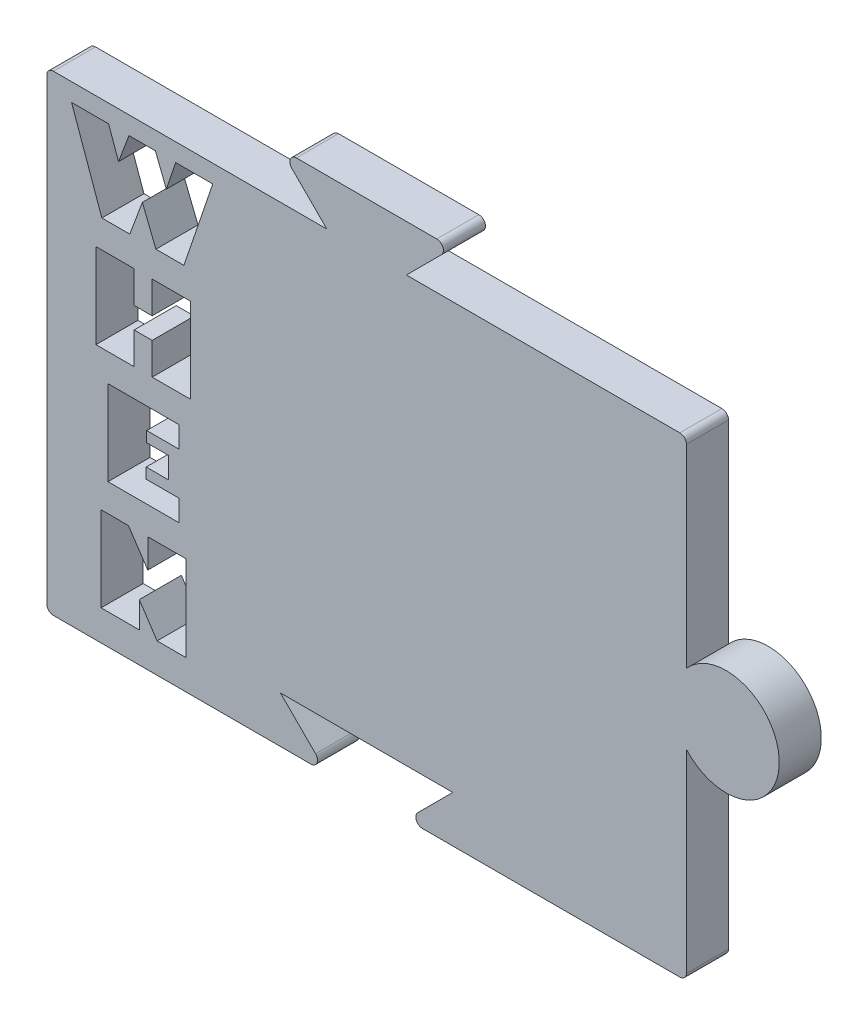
from build123d import *

# Parameters (mm, degrees)
BOSS_EXTRUDE1_DEPTH = 3.175
CUT_EXTRUDE3_DEPTH  = 68.745345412
FILLET1_R           = 0.5


with BuildPart() as part:
    # Sketch1 → Boss-Extrude1 (new body)
    with BuildSketch(Plane.XY):
        with BuildLine():
            Line((48.26, 35.56), (48.26, 20.425751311))
            ThreePointArc((48.26, 20.425751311), (55.26, 17.78), (48.26, 15.134248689))
            Line((48.26, 15.134248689), (48.26, 0))
            Line((48.26, 0), (27.13, 0))
            Line((27.13, 0), (30.63, 3.5))
            Line((30.63, 3.5), (17.63, 3.5))
            Line((17.63, 3.5), (21.13, 0))
            Line((21.13, 0), (0, 0))
            Line((0, 0), (0, 35.56))
            Line((0, 35.56), (21.13, 35.56))
            Line((21.13, 35.56), (17.63, 39.06))
            Line((17.63, 39.06), (30.63, 39.06))
            Line((30.63, 39.06), (27.13, 35.56))
            Line((27.13, 35.56), (48.26, 35.56))
        make_face()
    extrude(amount=BOSS_EXTRUDE1_DEPTH)

    # Sketch4 → Cut-Extrude3 (cut, through all)
    with BuildSketch(Plane.XY.offset(3.175)):
        Polygon((6.261522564, 27.796386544), (4.155183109, 27.796386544), (1.869873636, 34.204264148), (4.663307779, 34.204264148), (5.414230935, 32.112943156), (6.20270025, 34.204264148), (8.190143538, 34.204264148), (9.017410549, 32.112943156), (9.724529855, 34.204264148), (12.522970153, 34.204264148), (10.344041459, 27.796386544), (8.23269585, 27.796386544), (7.211440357, 30.348273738), align=None)
        Polygon((6.589917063, 19.296386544), (3.706372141, 19.296386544), (3.706372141, 25.704264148), (6.589917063, 25.704264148), (6.589917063, 23.301310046), (7.951591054, 23.301310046), (7.951591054, 25.704264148), (10.835135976, 25.704264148), (10.835135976, 19.296386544), (7.951591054, 19.296386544), (7.951591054, 21.699340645), (6.589917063, 21.699340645), align=None)
        Polygon((9.982163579, 12.398355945), (9.982163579, 10.796386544), (4.615566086, 10.796386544), (4.615566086, 17.204264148), (9.982163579, 17.204264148), (9.982163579, 15.602294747), (7.539160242, 15.602294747), (7.539160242, 14.801310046), (9.181178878, 14.801310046), (9.181178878, 13.199340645), (7.499111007, 13.199340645), (7.499111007, 12.398355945), align=None)
        Polygon((10.504189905, 2.246325), (8.320255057, 2.246325), (6.979857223, 4.277572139), (6.979857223, 2.296386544), (4.096312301, 2.296386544), (4.096312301, 8.704264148), (6.160099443, 8.704264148), (7.620644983, 6.525335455), (7.620644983, 8.704264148), (10.504189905, 8.704264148), align=None)
    extrude(amount=-CUT_EXTRUDE3_DEPTH, mode=Mode.SUBTRACT)

    # Fillet1
    fillet1_edges = [part.edges().sort_by_distance(p)[0] for p in [
        (0, 35.56, 1.5875),
        (17.63, 39.06, 1.5875),
        (30.63, 39.06, 1.5875),
        (48.26, 35.56, 1.5875),
        (48.26, 0, 1.5875),
        (27.13, 0, 1.5875),
        (21.13, 0, 1.5875),
        (0, 0, 1.5875),
    ]]
    fillet(fillet1_edges, radius=FILLET1_R)


solid = part.part
